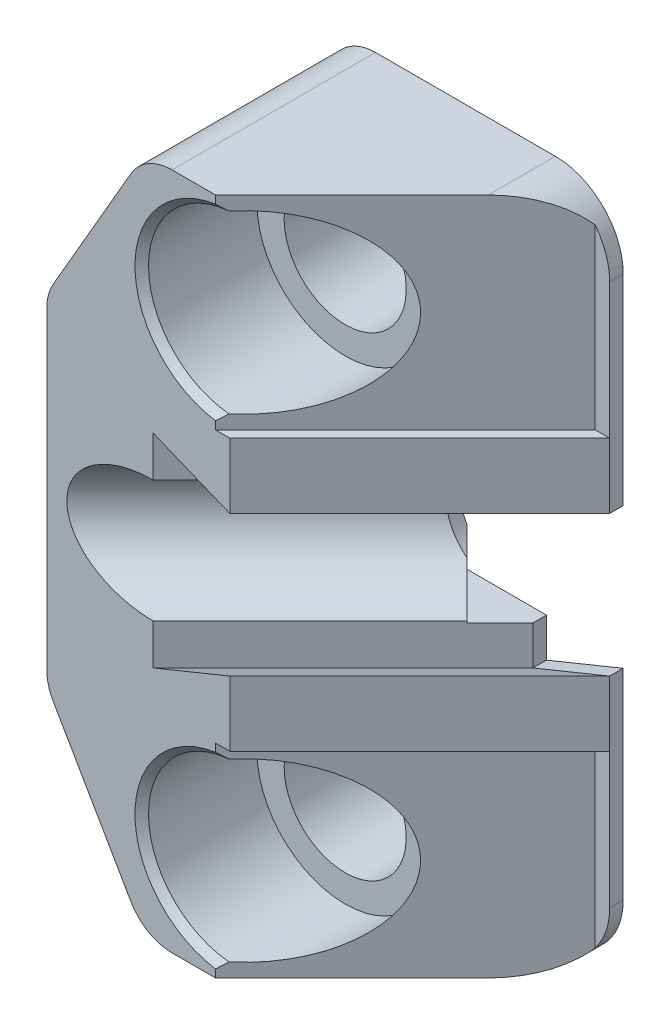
ISO-10303-21;
HEADER;
FILE_DESCRIPTION(('STEP AP214'),'2;1');
FILE_NAME('part.step','',(''),(''),'','','');
FILE_SCHEMA(('AUTOMOTIVE_DESIGN { 1 0 10303 214 1 1 1 1 }'));
ENDSEC;
DATA;
#1=APPLICATION_CONTEXT('core data for automotive mechanical design processes');
#2=APPLICATION_PROTOCOL_DEFINITION('international standard','automotive_design',2000,#1);
#3=PRODUCT_CONTEXT('',#1,'mechanical');
#4=PRODUCT('Part','Part','',(#3));
#5=PRODUCT_RELATED_PRODUCT_CATEGORY('part','',(#4));
#6=PRODUCT_DEFINITION_FORMATION('','',#4);
#7=PRODUCT_DEFINITION_CONTEXT('part definition',#1,'design');
#8=PRODUCT_DEFINITION('design','',#6,#7);
#9=PRODUCT_DEFINITION_SHAPE('','',#8);
#10=(LENGTH_UNIT() NAMED_UNIT(*) SI_UNIT(.MILLI.,.METRE.));
#11=(NAMED_UNIT(*) PLANE_ANGLE_UNIT() SI_UNIT($,.RADIAN.));
#12=(NAMED_UNIT(*) SI_UNIT($,.STERADIAN.) SOLID_ANGLE_UNIT());
#13=UNCERTAINTY_MEASURE_WITH_UNIT(LENGTH_MEASURE(1.E-05),#10,'distance_accuracy_value','');
#14=(GEOMETRIC_REPRESENTATION_CONTEXT(3) GLOBAL_UNCERTAINTY_ASSIGNED_CONTEXT((#13)) GLOBAL_UNIT_ASSIGNED_CONTEXT((#10,
#11,#12)) REPRESENTATION_CONTEXT('',''));
#15=CARTESIAN_POINT('',(0.,0.,0.));
#16=DIRECTION('',(0.,0.,1.));
#17=DIRECTION('',(1.,0.,0.));
#18=AXIS2_PLACEMENT_3D('',#15,#16,#17);
#19=CARTESIAN_POINT('',(28.,-15.,30.));
#20=DIRECTION('',(0.,1.,0.));
#21=DIRECTION('',(0.,0.,-1.));
#22=AXIS2_PLACEMENT_3D('',#19,#20,#21);
#23=PLANE('',#22);
#24=DIRECTION('',(-1.,0.,0.));
#25=VECTOR('',#24,1.);
#26=CARTESIAN_POINT('',(28.,-15.,0.));
#27=LINE('',#26,#25);
#28=CARTESIAN_POINT('',(18.,-15.,0.));
#29=VERTEX_POINT('',#28);
#30=CARTESIAN_POINT('',(-8.5247913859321,-15.,0.));
#31=VERTEX_POINT('',#30);
#32=EDGE_CURVE('E747',#29,#31,#27,.T.);
#33=ORIENTED_EDGE('',*,*,#32,.F.);
#34=DIRECTION('',(0.,0.,1.));
#35=VECTOR('',#34,1.);
#36=CARTESIAN_POINT('',(18.,-15.,30.));
#37=LINE('',#36,#35);
#38=CARTESIAN_POINT('',(18.,-15.,9.87867965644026));
#39=VERTEX_POINT('',#38);
#40=EDGE_CURVE('E422',#29,#39,#37,.T.);
#41=ORIENTED_EDGE('',*,*,#40,.T.);
#42=DIRECTION('',(-0.707106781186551,0.,0.707106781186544));
#43=VECTOR('',#42,1.);
#44=CARTESIAN_POINT('',(25.8786796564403,-15.,2.));
#45=LINE('',#44,#43);
#46=CARTESIAN_POINT('',(-2.12132034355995,-15.,30.));
#47=VERTEX_POINT('',#46);
#48=EDGE_CURVE('E286',#39,#47,#45,.T.);
#49=ORIENTED_EDGE('',*,*,#48,.T.);
#50=DIRECTION('',(1.,0.,0.));
#51=VECTOR('',#50,1.);
#52=CARTESIAN_POINT('',(28.,-15.,30.));
#53=LINE('',#52,#51);
#54=CARTESIAN_POINT('',(-8.5247913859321,-15.,30.));
#55=VERTEX_POINT('',#54);
#56=EDGE_CURVE('E648',#55,#47,#53,.T.);
#57=ORIENTED_EDGE('',*,*,#56,.F.);
#58=DIRECTION('',(0.,0.,1.));
#59=VECTOR('',#58,1.);
#60=CARTESIAN_POINT('',(-8.5247913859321,-15.,30.));
#61=LINE('',#60,#59);
#62=EDGE_CURVE('E677',#55,#31,#61,.F.);
#63=ORIENTED_EDGE('',*,*,#62,.T.);
#64=EDGE_LOOP('',(#33,#41,#49,#57,#63));
#65=FACE_BOUND('',#64,.T.);
#66=ADVANCED_FACE('F14',(#65),#23,.F.);
#67=CARTESIAN_POINT('',(28.,85.,30.));
#68=DIRECTION('',(0.,0.,1.));
#69=DIRECTION('',(-1.,0.,0.));
#70=AXIS2_PLACEMENT_3D('',#67,#68,#69);
#71=PLANE('',#70);
#72=ORIENTED_EDGE('',*,*,#56,.T.);
#73=DIRECTION('',(0.,-1.,0.));
#74=VECTOR('',#73,1.);
#75=CARTESIAN_POINT('',(-2.12132034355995,15.,30.));
#76=LINE('',#75,#74);
#77=CARTESIAN_POINT('',(-2.12132034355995,-13.838352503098,30.));
#78=VERTEX_POINT('',#77);
#79=EDGE_CURVE('E299',#78,#47,#76,.T.);
#80=ORIENTED_EDGE('',*,*,#79,.F.);
#81=CARTESIAN_POINT('',(0.,0.,30.));
#82=DIRECTION('',(0.,0.,1.));
#83=DIRECTION('',(-1.,0.,0.));
#84=AXIS2_PLACEMENT_3D('',#81,#82,#83);
#85=CIRCLE('',#84,14.);
#86=CARTESIAN_POINT('',(-2.12132034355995,13.838352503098,30.));
#87=VERTEX_POINT('',#86);
#88=EDGE_CURVE('E660',#78,#87,#85,.F.);
#89=ORIENTED_EDGE('',*,*,#88,.T.);
#90=CARTESIAN_POINT('',(-2.12132034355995,15.,30.));
#91=VERTEX_POINT('',#90);
#92=EDGE_CURVE('E304',#91,#87,#76,.T.);
#93=ORIENTED_EDGE('',*,*,#92,.F.);
#94=DIRECTION('',(1.,0.,0.));
#95=VECTOR('',#94,1.);
#96=CARTESIAN_POINT('',(-2.12132034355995,15.,30.));
#97=LINE('',#96,#95);
#98=CARTESIAN_POINT('',(-2.88831458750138E-13,15.,30.));
#99=VERTEX_POINT('',#98);
#100=EDGE_CURVE('E294',#91,#99,#97,.T.);
#101=ORIENTED_EDGE('',*,*,#100,.T.);
#102=DIRECTION('',(0.,1.,0.));
#103=VECTOR('',#102,1.);
#104=CARTESIAN_POINT('',(-2.88831458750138E-13,-15.,30.));
#105=LINE('',#104,#103);
#106=CARTESIAN_POINT('',(-2.9316826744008E-13,24.618802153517,30.));
#107=VERTEX_POINT('',#106);
#108=EDGE_CURVE('E640',#99,#107,#105,.T.);
#109=ORIENTED_EDGE('',*,*,#108,.T.);
#110=DIRECTION('',(0.925820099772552,0.377964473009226,0.));
#111=VECTOR('',#110,1.);
#112=CARTESIAN_POINT('',(45.1290178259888,43.0426465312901,30.));
#113=LINE('',#112,#111);
#114=CARTESIAN_POINT('',(-11.313708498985,20.,30.));
#115=VERTEX_POINT('',#114);
#116=EDGE_CURVE('E578',#115,#107,#113,.T.);
#117=ORIENTED_EDGE('',*,*,#116,.F.);
#118=DIRECTION('',(0.,-1.,0.));
#119=VECTOR('',#118,1.);
#120=CARTESIAN_POINT('',(-11.3137084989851,85.,30.));
#121=LINE('',#120,#119);
#122=CARTESIAN_POINT('',(-11.313708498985,26.,30.));
#123=VERTEX_POINT('',#122);
#124=EDGE_CURVE('E625',#123,#115,#121,.T.);
#125=ORIENTED_EDGE('',*,*,#124,.F.);
#126=CARTESIAN_POINT('',(-11.313708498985,35.,30.));
#127=DIRECTION('',(0.,0.,1.));
#128=DIRECTION('',(-1.,0.,0.));
#129=AXIS2_PLACEMENT_3D('',#126,#127,#128);
#130=ELLIPSE('',#129,12.7279220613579,9.);
#131=CARTESIAN_POINT('',(-11.313708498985,44.,30.));
#132=VERTEX_POINT('',#131);
#133=EDGE_CURVE('E622',#132,#123,#130,.T.);
#134=ORIENTED_EDGE('',*,*,#133,.F.);
#135=DIRECTION('',(0.,-1.,0.));
#136=VECTOR('',#135,1.);
#137=CARTESIAN_POINT('',(-11.3137084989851,85.,30.));
#138=LINE('',#137,#136);
#139=CARTESIAN_POINT('',(-11.313708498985,50.,30.));
#140=VERTEX_POINT('',#139);
#141=EDGE_CURVE('E619',#140,#132,#138,.T.);
#142=ORIENTED_EDGE('',*,*,#141,.F.);
#143=DIRECTION('',(-0.925820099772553,0.377964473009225,0.));
#144=VECTOR('',#143,1.);
#145=CARTESIAN_POINT('',(10.1363072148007,41.243067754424,30.));
#146=LINE('',#145,#144);
#147=CARTESIAN_POINT('',(-2.83627288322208E-13,45.381197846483,30.));
#148=VERTEX_POINT('',#147);
#149=EDGE_CURVE('E577',#148,#140,#146,.T.);
#150=ORIENTED_EDGE('',*,*,#149,.F.);
#151=CARTESIAN_POINT('',(-2.9316826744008E-13,55.,30.));
#152=VERTEX_POINT('',#151);
#153=EDGE_CURVE('E639',#148,#152,#105,.T.);
#154=ORIENTED_EDGE('',*,*,#153,.T.);
#155=DIRECTION('',(1.,0.,0.));
#156=VECTOR('',#155,1.);
#157=CARTESIAN_POINT('',(-2.12132034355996,55.,30.));
#158=LINE('',#157,#156);
#159=CARTESIAN_POINT('',(-2.12132034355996,55.,30.));
#160=VERTEX_POINT('',#159);
#161=EDGE_CURVE('E315',#160,#152,#158,.T.);
#162=ORIENTED_EDGE('',*,*,#161,.F.);
#163=DIRECTION('',(0.,1.,0.));
#164=VECTOR('',#163,1.);
#165=CARTESIAN_POINT('',(-2.12132034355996,55.,30.));
#166=LINE('',#165,#164);
#167=CARTESIAN_POINT('',(-2.12132034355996,56.161647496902,30.));
#168=VERTEX_POINT('',#167);
#169=EDGE_CURVE('E325',#160,#168,#166,.T.);
#170=ORIENTED_EDGE('',*,*,#169,.T.);
#171=CARTESIAN_POINT('',(0.,70.,30.));
#172=DIRECTION('',(0.,0.,1.));
#173=DIRECTION('',(-1.,0.,0.));
#174=AXIS2_PLACEMENT_3D('',#171,#172,#173);
#175=CIRCLE('',#174,14.);
#176=CARTESIAN_POINT('',(-2.12132034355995,83.838352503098,30.));
#177=VERTEX_POINT('',#176);
#178=EDGE_CURVE('E663',#168,#177,#175,.F.);
#179=ORIENTED_EDGE('',*,*,#178,.T.);
#180=CARTESIAN_POINT('',(-2.12132034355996,85.,30.));
#181=VERTEX_POINT('',#180);
#182=EDGE_CURVE('E328',#177,#181,#166,.T.);
#183=ORIENTED_EDGE('',*,*,#182,.T.);
#184=DIRECTION('',(-1.,0.,0.));
#185=VECTOR('',#184,1.);
#186=CARTESIAN_POINT('',(28.,85.,30.));
#187=LINE('',#186,#185);
#188=CARTESIAN_POINT('',(-8.52479138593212,85.,30.));
#189=VERTEX_POINT('',#188);
#190=EDGE_CURVE('E645',#181,#189,#187,.T.);
#191=ORIENTED_EDGE('',*,*,#190,.T.);
#192=CARTESIAN_POINT('',(-8.52479138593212,78.,30.));
#193=DIRECTION('',(0.,0.,1.));
#194=DIRECTION('',(-1.,0.,0.));
#195=AXIS2_PLACEMENT_3D('',#192,#193,#194);
#196=CIRCLE('',#195,7.);
#197=CARTESIAN_POINT('',(-14.5869692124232,81.5,30.));
#198=VERTEX_POINT('',#197);
#199=EDGE_CURVE('E672',#189,#198,#196,.T.);
#200=ORIENTED_EDGE('',*,*,#199,.T.);
#201=DIRECTION('',(0.5,0.866025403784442,0.));
#202=VECTOR('',#201,1.);
#203=CARTESIAN_POINT('',(-27.,60.,30.));
#204=LINE('',#203,#202);
#205=CARTESIAN_POINT('',(-26.0621778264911,61.6243556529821,30.));
#206=VERTEX_POINT('',#205);
#207=EDGE_CURVE('E584',#206,#198,#204,.T.);
#208=ORIENTED_EDGE('',*,*,#207,.F.);
#209=CARTESIAN_POINT('',(-20.,58.1243556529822,30.));
#210=DIRECTION('',(0.,0.,1.));
#211=DIRECTION('',(-1.,0.,0.));
#212=AXIS2_PLACEMENT_3D('',#209,#210,#211);
#213=CIRCLE('',#212,7.);
#214=CARTESIAN_POINT('',(-27.,58.1243556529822,30.));
#215=VERTEX_POINT('',#214);
#216=EDGE_CURVE('E695',#206,#215,#213,.T.);
#217=ORIENTED_EDGE('',*,*,#216,.T.);
#218=DIRECTION('',(0.,1.,0.));
#219=VECTOR('',#218,1.);
#220=CARTESIAN_POINT('',(-27.,-15.,30.));
#221=LINE('',#220,#219);
#222=CARTESIAN_POINT('',(-27.,11.8756443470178,30.));
#223=VERTEX_POINT('',#222);
#224=EDGE_CURVE('E595',#223,#215,#221,.T.);
#225=ORIENTED_EDGE('',*,*,#224,.F.);
#226=CARTESIAN_POINT('',(-20.,11.8756443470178,30.));
#227=DIRECTION('',(0.,0.,1.));
#228=DIRECTION('',(-1.,0.,0.));
#229=AXIS2_PLACEMENT_3D('',#226,#227,#228);
#230=CIRCLE('',#229,7.);
#231=CARTESIAN_POINT('',(-26.0621778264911,8.3756443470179,30.));
#232=VERTEX_POINT('',#231);
#233=EDGE_CURVE('E697',#223,#232,#230,.T.);
#234=ORIENTED_EDGE('',*,*,#233,.T.);
#235=DIRECTION('',(-0.5,0.866025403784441,0.));
#236=VECTOR('',#235,1.);
#237=CARTESIAN_POINT('',(-27.,10.,30.));
#238=LINE('',#237,#236);
#239=CARTESIAN_POINT('',(-14.5869692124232,-11.5,30.));
#240=VERTEX_POINT('',#239);
#241=EDGE_CURVE('E592',#240,#232,#238,.T.);
#242=ORIENTED_EDGE('',*,*,#241,.F.);
#243=CARTESIAN_POINT('',(-8.52479138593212,-8.,30.));
#244=DIRECTION('',(0.,0.,1.));
#245=DIRECTION('',(-1.,0.,0.));
#246=AXIS2_PLACEMENT_3D('',#243,#244,#245);
#247=CIRCLE('',#246,7.);
#248=EDGE_CURVE('E675',#240,#55,#247,.T.);
#249=ORIENTED_EDGE('',*,*,#248,.T.);
#250=EDGE_LOOP('',(#72,#80,#89,#93,#101,#109,#117,#125,#134,#142,#150,#154,#162,#170,#179,#183,
#191,#200,#208,#217,#225,#234,#242,#249));
#251=FACE_BOUND('',#250,.T.);
#252=ADVANCED_FACE('F487',(#251),#71,.T.);
#253=CARTESIAN_POINT('',(28.,-15.,2.));
#254=DIRECTION('',(-0.707106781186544,0.,-0.707106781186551));
#255=DIRECTION('',(0.707106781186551,0.,-0.707106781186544));
#256=AXIS2_PLACEMENT_3D('',#253,#254,#255);
#257=PLANE('',#256);
#258=DIRECTION('',(0.707106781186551,0.,-0.707106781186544));
#259=VECTOR('',#258,1.);
#260=CARTESIAN_POINT('',(28.,15.,2.));
#261=LINE('',#260,#259);
#262=CARTESIAN_POINT('',(28.,15.,2.));
#263=VERTEX_POINT('',#262);
#264=EDGE_CURVE('E291',#99,#263,#261,.T.);
#265=ORIENTED_EDGE('',*,*,#264,.T.);
#266=DIRECTION('',(0.,1.,0.));
#267=VECTOR('',#266,1.);
#268=CARTESIAN_POINT('',(28.,-15.,2.));
#269=LINE('',#268,#267);
#270=CARTESIAN_POINT('',(28.,24.618802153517,1.99999999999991));
#271=VERTEX_POINT('',#270);
#272=EDGE_CURVE('E646',#263,#271,#269,.T.);
#273=ORIENTED_EDGE('',*,*,#272,.T.);
#274=DIRECTION('',(-0.707106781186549,0.,0.707106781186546));
#275=VECTOR('',#274,1.);
#276=CARTESIAN_POINT('',(28.,24.618802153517,1.99999999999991));
#277=LINE('',#276,#275);
#278=EDGE_CURVE('E602',#271,#107,#277,.T.);
#279=ORIENTED_EDGE('',*,*,#278,.T.);
#280=ORIENTED_EDGE('',*,*,#108,.F.);
#281=EDGE_LOOP('',(#265,#273,#279,#280));
#282=FACE_BOUND('',#281,.T.);
#283=ADVANCED_FACE('F493',(#282),#257,.F.);
#284=CARTESIAN_POINT('',(0.,0.,30.));
#285=DIRECTION('',(0.,0.,1.));
#286=DIRECTION('',(-1.,0.,0.));
#287=AXIS2_PLACEMENT_3D('',#284,#285,#286);
#288=CYLINDRICAL_SURFACE('',#287,13.);
#289=CARTESIAN_POINT('',(0.,0.,13.));
#290=DIRECTION('',(0.,0.,1.));
#291=DIRECTION('',(-1.,0.,0.));
#292=AXIS2_PLACEMENT_3D('',#289,#290,#291);
#293=CIRCLE('',#292,13.);
#294=CARTESIAN_POINT('',(-13.,0.,13.));
#295=VERTEX_POINT('',#294);
#296=EDGE_CURVE('E630',#295,#295,#293,.T.);
#297=ORIENTED_EDGE('',*,*,#296,.F.);
#298=EDGE_LOOP('',(#297));
#299=FACE_BOUND('',#298,.T.);
#300=CARTESIAN_POINT('',(0.,0.,27.8786796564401));
#301=DIRECTION('',(0.707106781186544,0.,0.707106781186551));
#302=DIRECTION('',(-0.707106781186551,0.,0.707106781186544));
#303=AXIS2_PLACEMENT_3D('',#300,#301,#302);
#304=ELLIPSE('',#303,18.3847763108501,13.);
#305=CARTESIAN_POINT('',(-1.12132034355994,12.9515497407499,29.));
#306=VERTEX_POINT('',#305);
#307=CARTESIAN_POINT('',(-1.12132034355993,-12.9515497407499,29.));
#308=VERTEX_POINT('',#307);
#309=EDGE_CURVE('E303',#306,#308,#304,.F.);
#310=ORIENTED_EDGE('',*,*,#309,.F.);
#311=CARTESIAN_POINT('',(0.,0.,29.));
#312=DIRECTION('',(0.,0.,1.));
#313=DIRECTION('',(-1.,0.,0.));
#314=AXIS2_PLACEMENT_3D('',#311,#312,#313);
#315=CIRCLE('',#314,13.);
#316=EDGE_CURVE('E666',#306,#308,#315,.T.);
#317=ORIENTED_EDGE('',*,*,#316,.T.);
#318=EDGE_LOOP('',(#310,#317));
#319=FACE_BOUND('',#318,.T.);
#320=ADVANCED_FACE('F430',(#299,#319),#288,.F.);
#321=CARTESIAN_POINT('',(0.,0.,29.));
#322=DIRECTION('',(0.,0.,1.));
#323=DIRECTION('',(-1.,0.,0.));
#324=AXIS2_PLACEMENT_3D('',#321,#322,#323);
#325=CONICAL_SURFACE('',#324,13.,0.78539816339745);
#326=ORIENTED_EDGE('',*,*,#316,.F.);
#327=CARTESIAN_POINT('',(-1.12112034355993,12.9513663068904,28.9998));
#328=CARTESIAN_POINT('',(-1.20368506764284,13.0270922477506,29.0823647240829));
#329=CARTESIAN_POINT('',(-1.28646372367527,13.1023511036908,29.1651433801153));
#330=CARTESIAN_POINT('',(-1.45242484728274,13.2519586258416,29.3311045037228));
#331=CARTESIAN_POINT('',(-1.53560729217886,13.3263073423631,29.4142869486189));
#332=CARTESIAN_POINT('',(-1.70236068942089,13.4741265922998,29.581040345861));
#333=CARTESIAN_POINT('',(-1.78593163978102,13.5475971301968,29.6646112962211));
#334=CARTESIAN_POINT('',(-1.95344952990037,13.6936907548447,29.8321291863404));
#335=CARTESIAN_POINT('',(-2.03739649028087,13.7663137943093,29.9160761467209));
#336=CARTESIAN_POINT('',(-2.12152034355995,13.8385241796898,30.0002));
#337=B_SPLINE_CURVE_WITH_KNOTS('',3,(#327,#328,#329,#330,#331,#332,#333,#334,#335,#336),
.UNSPECIFIED.,.F.,.F.,(4,2,2,2,4),(0.,0.417508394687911,0.834993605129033,1.2524766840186,
1.66998294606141),.UNSPECIFIED.);
#338=EDGE_CURVE('E415',#306,#87,#337,.T.);
#339=ORIENTED_EDGE('',*,*,#338,.T.);
#340=ORIENTED_EDGE('',*,*,#88,.F.);
#341=CARTESIAN_POINT('',(-2.12152034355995,-13.8385241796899,30.0002));
#342=CARTESIAN_POINT('',(-2.03739649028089,-13.7663137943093,29.9160761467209));
#343=CARTESIAN_POINT('',(-1.9534495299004,-13.6936907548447,29.8321291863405));
#344=CARTESIAN_POINT('',(-1.78593163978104,-13.5475971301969,29.6646112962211));
#345=CARTESIAN_POINT('',(-1.70236068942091,-13.4741265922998,29.581040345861));
#346=CARTESIAN_POINT('',(-1.53560729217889,-13.3263073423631,29.414286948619));
#347=CARTESIAN_POINT('',(-1.45242484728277,-13.2519586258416,29.3311045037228));
#348=CARTESIAN_POINT('',(-1.28646372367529,-13.1023511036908,29.1651433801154));
#349=CARTESIAN_POINT('',(-1.20368506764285,-13.0270922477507,29.0823647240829));
#350=CARTESIAN_POINT('',(-1.1211203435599,-12.9513663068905,28.9998));
#351=B_SPLINE_CURVE_WITH_KNOTS('',3,(#341,#342,#343,#344,#345,#346,#347,#348,#349,#350),
.UNSPECIFIED.,.F.,.F.,(4,2,2,2,4),(0.,0.417506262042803,0.834989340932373,1.2524745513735,
1.6699829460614),.UNSPECIFIED.);
#352=EDGE_CURVE('E407',#78,#308,#351,.T.);
#353=ORIENTED_EDGE('',*,*,#352,.T.);
#354=EDGE_LOOP('',(#326,#339,#340,#353));
#355=FACE_BOUND('',#354,.T.);
#356=ADVANCED_FACE('F424',(#355),#325,.F.);
#357=DIRECTION('',(0.707106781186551,0.,-0.707106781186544));
#358=VECTOR('',#357,1.);
#359=CARTESIAN_POINT('',(28.,55.,2.));
#360=LINE('',#359,#358);
#361=CARTESIAN_POINT('',(28.,55.,2.));
#362=VERTEX_POINT('',#361);
#363=EDGE_CURVE('E317',#152,#362,#360,.T.);
#364=ORIENTED_EDGE('',*,*,#363,.F.);
#365=ORIENTED_EDGE('',*,*,#153,.F.);
#366=DIRECTION('',(-0.707106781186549,0.,0.707106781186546));
#367=VECTOR('',#366,1.);
#368=CARTESIAN_POINT('',(28.,45.381197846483,1.99999999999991));
#369=LINE('',#368,#367);
#370=CARTESIAN_POINT('',(28.,45.381197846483,1.99999999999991));
#371=VERTEX_POINT('',#370);
#372=EDGE_CURVE('E599',#371,#148,#369,.T.);
#373=ORIENTED_EDGE('',*,*,#372,.F.);
#374=EDGE_CURVE('E642',#371,#362,#269,.T.);
#375=ORIENTED_EDGE('',*,*,#374,.T.);
#376=EDGE_LOOP('',(#364,#365,#373,#375));
#377=FACE_BOUND('',#376,.T.);
#378=ADVANCED_FACE('F429',(#377),#257,.F.);
#379=CARTESIAN_POINT('',(28.,85.,30.));
#380=DIRECTION('',(0.,-1.,0.));
#381=DIRECTION('',(0.,0.,1.));
#382=AXIS2_PLACEMENT_3D('',#379,#380,#381);
#383=PLANE('',#382);
#384=DIRECTION('',(-0.707106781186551,0.,0.707106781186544));
#385=VECTOR('',#384,1.);
#386=CARTESIAN_POINT('',(25.8786796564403,85.,2.));
#387=LINE('',#386,#385);
#388=CARTESIAN_POINT('',(18.,85.,9.87867965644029));
#389=VERTEX_POINT('',#388);
#390=EDGE_CURVE('E307',#389,#181,#387,.T.);
#391=ORIENTED_EDGE('',*,*,#390,.F.);
#392=DIRECTION('',(0.,0.,1.));
#393=VECTOR('',#392,1.);
#394=CARTESIAN_POINT('',(18.,85.,30.));
#395=LINE('',#394,#393);
#396=CARTESIAN_POINT('',(18.,85.,0.));
#397=VERTEX_POINT('',#396);
#398=EDGE_CURVE('E721',#389,#397,#395,.F.);
#399=ORIENTED_EDGE('',*,*,#398,.T.);
#400=DIRECTION('',(1.,0.,0.));
#401=VECTOR('',#400,1.);
#402=CARTESIAN_POINT('',(-12.5662432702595,85.,0.));
#403=LINE('',#402,#401);
#404=CARTESIAN_POINT('',(-8.52479138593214,85.,0.));
#405=VERTEX_POINT('',#404);
#406=EDGE_CURVE('E341',#405,#397,#403,.T.);
#407=ORIENTED_EDGE('',*,*,#406,.F.);
#408=DIRECTION('',(0.,0.,1.));
#409=VECTOR('',#408,1.);
#410=CARTESIAN_POINT('',(-8.52479138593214,85.,30.));
#411=LINE('',#410,#409);
#412=EDGE_CURVE('E684',#405,#189,#411,.T.);
#413=ORIENTED_EDGE('',*,*,#412,.T.);
#414=ORIENTED_EDGE('',*,*,#190,.F.);
#415=EDGE_LOOP('',(#391,#399,#407,#413,#414));
#416=FACE_BOUND('',#415,.T.);
#417=ADVANCED_FACE('F16',(#416),#383,.F.);
#418=CARTESIAN_POINT('',(0.,70.,30.));
#419=DIRECTION('',(0.,0.,1.));
#420=DIRECTION('',(-1.,0.,0.));
#421=AXIS2_PLACEMENT_3D('',#418,#419,#420);
#422=CYLINDRICAL_SURFACE('',#421,13.);
#423=CARTESIAN_POINT('',(0.,70.,13.));
#424=DIRECTION('',(0.,0.,1.));
#425=DIRECTION('',(-1.,0.,0.));
#426=AXIS2_PLACEMENT_3D('',#423,#424,#425);
#427=CIRCLE('',#426,13.);
#428=CARTESIAN_POINT('',(-13.,70.,13.));
#429=VERTEX_POINT('',#428);
#430=EDGE_CURVE('E636',#429,#429,#427,.T.);
#431=ORIENTED_EDGE('',*,*,#430,.F.);
#432=EDGE_LOOP('',(#431));
#433=FACE_BOUND('',#432,.T.);
#434=CARTESIAN_POINT('',(0.,70.,29.));
#435=DIRECTION('',(0.,0.,1.));
#436=DIRECTION('',(-1.,0.,0.));
#437=AXIS2_PLACEMENT_3D('',#434,#435,#436);
#438=CIRCLE('',#437,13.);
#439=CARTESIAN_POINT('',(-1.12132034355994,82.9515497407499,29.));
#440=VERTEX_POINT('',#439);
#441=CARTESIAN_POINT('',(-1.12132034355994,57.0484502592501,29.));
#442=VERTEX_POINT('',#441);
#443=EDGE_CURVE('E657',#440,#442,#438,.T.);
#444=ORIENTED_EDGE('',*,*,#443,.T.);
#445=CARTESIAN_POINT('',(0.,70.,27.8786796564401));
#446=DIRECTION('',(-0.707106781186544,0.,-0.707106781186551));
#447=DIRECTION('',(-0.707106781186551,0.,0.707106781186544));
#448=AXIS2_PLACEMENT_3D('',#445,#446,#447);
#449=ELLIPSE('',#448,18.3847763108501,13.);
#450=EDGE_CURVE('E324',#442,#440,#449,.F.);
#451=ORIENTED_EDGE('',*,*,#450,.T.);
#452=EDGE_LOOP('',(#444,#451));
#453=FACE_BOUND('',#452,.T.);
#454=ADVANCED_FACE('F501',(#433,#453),#422,.F.);
#455=CARTESIAN_POINT('',(-9.,70.,13.));
#456=DIRECTION('',(0.,0.,-1.));
#457=DIRECTION('',(1.,0.,0.));
#458=AXIS2_PLACEMENT_3D('',#455,#456,#457);
#459=PLANE('',#458);
#460=CARTESIAN_POINT('',(0.,70.,13.));
#461=DIRECTION('',(0.,0.,1.));
#462=DIRECTION('',(-1.,0.,0.));
#463=AXIS2_PLACEMENT_3D('',#460,#461,#462);
#464=CIRCLE('',#463,9.);
#465=CARTESIAN_POINT('',(-9.,70.,13.));
#466=VERTEX_POINT('',#465);
#467=EDGE_CURVE('E633',#466,#466,#464,.T.);
#468=ORIENTED_EDGE('',*,*,#467,.F.);
#469=EDGE_LOOP('',(#468));
#470=FACE_BOUND('',#469,.T.);
#471=ORIENTED_EDGE('',*,*,#430,.T.);
#472=EDGE_LOOP('',(#471));
#473=FACE_BOUND('',#472,.T.);
#474=ADVANCED_FACE('F504',(#470,#473),#459,.F.);
#475=CARTESIAN_POINT('',(0.,70.,30.));
#476=DIRECTION('',(0.,0.,1.));
#477=DIRECTION('',(-1.,0.,0.));
#478=AXIS2_PLACEMENT_3D('',#475,#476,#477);
#479=CYLINDRICAL_SURFACE('',#478,9.);
#480=ORIENTED_EDGE('',*,*,#467,.T.);
#481=EDGE_LOOP('',(#480));
#482=FACE_BOUND('',#481,.T.);
#483=CARTESIAN_POINT('',(0.,70.,0.));
#484=DIRECTION('',(0.,0.,1.));
#485=DIRECTION('',(-1.,0.,0.));
#486=AXIS2_PLACEMENT_3D('',#483,#484,#485);
#487=CIRCLE('',#486,9.);
#488=CARTESIAN_POINT('',(-9.,70.,0.));
#489=VERTEX_POINT('',#488);
#490=EDGE_CURVE('E257',#489,#489,#487,.T.);
#491=ORIENTED_EDGE('',*,*,#490,.F.);
#492=EDGE_LOOP('',(#491));
#493=FACE_BOUND('',#492,.T.);
#494=ADVANCED_FACE('F508',(#482,#493),#479,.F.);
#495=CARTESIAN_POINT('',(-9.,0.,13.));
#496=DIRECTION('',(0.,0.,-1.));
#497=DIRECTION('',(1.,0.,0.));
#498=AXIS2_PLACEMENT_3D('',#495,#496,#497);
#499=PLANE('',#498);
#500=CARTESIAN_POINT('',(0.,0.,13.));
#501=DIRECTION('',(0.,0.,1.));
#502=DIRECTION('',(-1.,0.,0.));
#503=AXIS2_PLACEMENT_3D('',#500,#501,#502);
#504=CIRCLE('',#503,9.);
#505=CARTESIAN_POINT('',(-9.,0.,13.));
#506=VERTEX_POINT('',#505);
#507=EDGE_CURVE('E627',#506,#506,#504,.T.);
#508=ORIENTED_EDGE('',*,*,#507,.F.);
#509=EDGE_LOOP('',(#508));
#510=FACE_BOUND('',#509,.T.);
#511=ORIENTED_EDGE('',*,*,#296,.T.);
#512=EDGE_LOOP('',(#511));
#513=FACE_BOUND('',#512,.T.);
#514=ADVANCED_FACE('F512',(#510,#513),#499,.F.);
#515=CARTESIAN_POINT('',(0.,0.,30.));
#516=DIRECTION('',(0.,0.,1.));
#517=DIRECTION('',(-1.,0.,0.));
#518=AXIS2_PLACEMENT_3D('',#515,#516,#517);
#519=CYLINDRICAL_SURFACE('',#518,9.);
#520=ORIENTED_EDGE('',*,*,#507,.T.);
#521=EDGE_LOOP('',(#520));
#522=FACE_BOUND('',#521,.T.);
#523=CARTESIAN_POINT('',(0.,0.,0.));
#524=DIRECTION('',(0.,0.,1.));
#525=DIRECTION('',(-1.,0.,0.));
#526=AXIS2_PLACEMENT_3D('',#523,#524,#525);
#527=CIRCLE('',#526,9.);
#528=CARTESIAN_POINT('',(-9.,0.,0.));
#529=VERTEX_POINT('',#528);
#530=EDGE_CURVE('E809',#529,#529,#527,.T.);
#531=ORIENTED_EDGE('',*,*,#530,.F.);
#532=EDGE_LOOP('',(#531));
#533=FACE_BOUND('',#532,.T.);
#534=ADVANCED_FACE('F519',(#522,#533),#519,.F.);
#535=CARTESIAN_POINT('',(22.3431457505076,20.,-3.65685424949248));
#536=DIRECTION('',(-0.707106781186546,0.,-0.707106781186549));
#537=DIRECTION('',(0.707106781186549,0.,-0.707106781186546));
#538=AXIS2_PLACEMENT_3D('',#535,#536,#537);
#539=PLANE('',#538);
#540=DIRECTION('',(-0.707106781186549,0.,0.707106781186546));
#541=VECTOR('',#540,1.);
#542=CARTESIAN_POINT('',(22.3431457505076,25.75,-3.65685424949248));
#543=LINE('',#542,#541);
#544=CARTESIAN_POINT('',(16.6862915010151,25.75,2.));
#545=VERTEX_POINT('',#544);
#546=CARTESIAN_POINT('',(11.8431457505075,25.75,6.84314575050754));
#547=VERTEX_POINT('',#546);
#548=EDGE_CURVE('E283',#545,#547,#543,.T.);
#549=ORIENTED_EDGE('',*,*,#548,.T.);
#550=DIRECTION('',(0.,1.,0.));
#551=VECTOR('',#550,1.);
#552=CARTESIAN_POINT('',(11.8431457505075,20.,6.84314575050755));
#553=LINE('',#552,#551);
#554=CARTESIAN_POINT('',(11.8431457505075,26.,6.84314575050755));
#555=VERTEX_POINT('',#554);
#556=EDGE_CURVE('E275',#547,#555,#553,.T.);
#557=ORIENTED_EDGE('',*,*,#556,.T.);
#558=DIRECTION('',(-0.707106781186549,0.,0.707106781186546));
#559=VECTOR('',#558,1.);
#560=CARTESIAN_POINT('',(22.3431457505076,26.,-3.65685424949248));
#561=LINE('',#560,#559);
#562=EDGE_CURVE('E608',#555,#123,#561,.T.);
#563=ORIENTED_EDGE('',*,*,#562,.T.);
#564=ORIENTED_EDGE('',*,*,#124,.T.);
#565=DIRECTION('',(-0.707106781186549,0.,0.707106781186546));
#566=VECTOR('',#565,1.);
#567=CARTESIAN_POINT('',(22.3431457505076,20.,-3.65685424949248));
#568=LINE('',#567,#566);
#569=CARTESIAN_POINT('',(16.6862915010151,20.,2.));
#570=VERTEX_POINT('',#569);
#571=EDGE_CURVE('E605',#570,#115,#568,.T.);
#572=ORIENTED_EDGE('',*,*,#571,.F.);
#573=DIRECTION('',(0.,-1.,0.));
#574=VECTOR('',#573,1.);
#575=CARTESIAN_POINT('',(16.686291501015,85.,2.));
#576=LINE('',#575,#574);
#577=EDGE_CURVE('E655',#545,#570,#576,.T.);
#578=ORIENTED_EDGE('',*,*,#577,.F.);
#579=EDGE_LOOP('',(#549,#557,#563,#564,#572,#578));
#580=FACE_BOUND('',#579,.T.);
#581=ADVANCED_FACE('F523',(#580),#539,.F.);
#582=CARTESIAN_POINT('',(22.3431457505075,35.,-3.65685424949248));
#583=DIRECTION('',(-0.707106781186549,0.,0.707106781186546));
#584=DIRECTION('',(-0.707106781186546,0.,-0.707106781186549));
#585=AXIS2_PLACEMENT_3D('',#582,#583,#584);
#586=CYLINDRICAL_SURFACE('',#585,9.);
#587=CARTESIAN_POINT('',(16.686291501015,35.,2.));
#588=DIRECTION('',(0.,0.,1.));
#589=DIRECTION('',(-1.,0.,0.));
#590=AXIS2_PLACEMENT_3D('',#587,#588,#589);
#591=ELLIPSE('',#590,12.7279220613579,9.);
#592=CARTESIAN_POINT('',(7.,40.8384825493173,2.));
#593=VERTEX_POINT('',#592);
#594=CARTESIAN_POINT('',(7.,29.1615174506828,2.));
#595=VERTEX_POINT('',#594);
#596=EDGE_CURVE('E652',#593,#595,#591,.T.);
#597=ORIENTED_EDGE('',*,*,#596,.F.);
#598=CARTESIAN_POINT('',(11.8431457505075,35.,6.84314575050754));
#599=DIRECTION('',(-0.707106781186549,0.,0.707106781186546));
#600=DIRECTION('',(-0.707106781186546,0.,-0.707106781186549));
#601=AXIS2_PLACEMENT_3D('',#598,#599,#600);
#602=CIRCLE('',#601,9.);
#603=CARTESIAN_POINT('',(11.8431457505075,44.,6.84314575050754));
#604=VERTEX_POINT('',#603);
#605=EDGE_CURVE('E276',#593,#604,#602,.F.);
#606=ORIENTED_EDGE('',*,*,#605,.T.);
#607=DIRECTION('',(-0.707106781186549,0.,0.707106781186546));
#608=VECTOR('',#607,1.);
#609=CARTESIAN_POINT('',(22.3431457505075,44.,-3.65685424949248));
#610=LINE('',#609,#608);
#611=EDGE_CURVE('E610',#604,#132,#610,.T.);
#612=ORIENTED_EDGE('',*,*,#611,.T.);
#613=ORIENTED_EDGE('',*,*,#133,.T.);
#614=ORIENTED_EDGE('',*,*,#562,.F.);
#615=EDGE_CURVE('E269',#555,#595,#602,.F.);
#616=ORIENTED_EDGE('',*,*,#615,.T.);
#617=EDGE_LOOP('',(#597,#606,#612,#613,#614,#616));
#618=FACE_BOUND('',#617,.T.);
#619=ADVANCED_FACE('F533',(#618),#586,.F.);
#620=CARTESIAN_POINT('',(22.3431457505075,44.,-3.65685424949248));
#621=DIRECTION('',(-0.707106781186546,0.,-0.707106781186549));
#622=DIRECTION('',(0.707106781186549,0.,-0.707106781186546));
#623=AXIS2_PLACEMENT_3D('',#620,#621,#622);
#624=PLANE('',#623);
#625=ORIENTED_EDGE('',*,*,#611,.F.);
#626=DIRECTION('',(0.,1.,0.));
#627=VECTOR('',#626,1.);
#628=CARTESIAN_POINT('',(11.8431457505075,44.,6.84314575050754));
#629=LINE('',#628,#627);
#630=CARTESIAN_POINT('',(11.8431457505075,44.25,6.84314575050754));
#631=VERTEX_POINT('',#630);
#632=EDGE_CURVE('E279',#604,#631,#629,.T.);
#633=ORIENTED_EDGE('',*,*,#632,.T.);
#634=DIRECTION('',(0.707106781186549,0.,-0.707106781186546));
#635=VECTOR('',#634,1.);
#636=CARTESIAN_POINT('',(22.3431457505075,44.25,-3.65685424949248));
#637=LINE('',#636,#635);
#638=CARTESIAN_POINT('',(16.686291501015,44.25,2.));
#639=VERTEX_POINT('',#638);
#640=EDGE_CURVE('E261',#631,#639,#637,.T.);
#641=ORIENTED_EDGE('',*,*,#640,.T.);
#642=DIRECTION('',(0.,-1.,0.));
#643=VECTOR('',#642,1.);
#644=CARTESIAN_POINT('',(16.686291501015,85.,2.));
#645=LINE('',#644,#643);
#646=CARTESIAN_POINT('',(16.686291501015,50.,2.));
#647=VERTEX_POINT('',#646);
#648=EDGE_CURVE('E581',#647,#639,#645,.T.);
#649=ORIENTED_EDGE('',*,*,#648,.F.);
#650=DIRECTION('',(-0.707106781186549,0.,0.707106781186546));
#651=VECTOR('',#650,1.);
#652=CARTESIAN_POINT('',(22.3431457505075,50.,-3.65685424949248));
#653=LINE('',#652,#651);
#654=EDGE_CURVE('E598',#647,#140,#653,.T.);
#655=ORIENTED_EDGE('',*,*,#654,.T.);
#656=ORIENTED_EDGE('',*,*,#141,.T.);
#657=EDGE_LOOP('',(#625,#633,#641,#649,#655,#656));
#658=FACE_BOUND('',#657,.T.);
#659=ADVANCED_FACE('F529',(#658),#624,.F.);
#660=CARTESIAN_POINT('',(22.3431457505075,50.,-3.65685424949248));
#661=DIRECTION('',(0.353553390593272,0.86602540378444,0.353553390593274));
#662=DIRECTION('',(0.,0.377964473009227,-0.925820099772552));
#663=AXIS2_PLACEMENT_3D('',#660,#661,#662);
#664=PLANE('',#663);
#665=ORIENTED_EDGE('',*,*,#149,.T.);
#666=ORIENTED_EDGE('',*,*,#654,.F.);
#667=DIRECTION('',(-0.925820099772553,0.377964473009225,0.));
#668=VECTOR('',#667,1.);
#669=CARTESIAN_POINT('',(14.1363072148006,51.0410267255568,2.));
#670=LINE('',#669,#668);
#671=EDGE_CURVE('E569',#371,#647,#670,.T.);
#672=ORIENTED_EDGE('',*,*,#671,.F.);
#673=ORIENTED_EDGE('',*,*,#372,.T.);
#674=EDGE_LOOP('',(#665,#666,#672,#673));
#675=FACE_BOUND('',#674,.T.);
#676=ADVANCED_FACE('F525',(#675),#664,.F.);
#677=CARTESIAN_POINT('',(22.3431457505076,20.,-3.65685424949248));
#678=DIRECTION('',(0.353553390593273,-0.866025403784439,0.353553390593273));
#679=DIRECTION('',(0.,0.377964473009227,0.925820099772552));
#680=AXIS2_PLACEMENT_3D('',#677,#678,#679);
#681=PLANE('',#680);
#682=ORIENTED_EDGE('',*,*,#116,.T.);
#683=ORIENTED_EDGE('',*,*,#278,.F.);
#684=DIRECTION('',(0.925820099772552,0.377964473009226,0.));
#685=VECTOR('',#684,1.);
#686=CARTESIAN_POINT('',(49.1290178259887,33.2446875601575,2.));
#687=LINE('',#686,#685);
#688=EDGE_CURVE('E601',#570,#271,#687,.T.);
#689=ORIENTED_EDGE('',*,*,#688,.F.);
#690=ORIENTED_EDGE('',*,*,#571,.T.);
#691=EDGE_LOOP('',(#682,#683,#689,#690));
#692=FACE_BOUND('',#691,.T.);
#693=ADVANCED_FACE('F528',(#692),#681,.F.);
#694=CARTESIAN_POINT('',(-27.,-15.,1.9999999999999));
#695=DIRECTION('',(1.,0.,0.));
#696=DIRECTION('',(0.,1.,0.));
#697=AXIS2_PLACEMENT_3D('',#694,#695,#696);
#698=PLANE('',#697);
#699=DIRECTION('',(0.,1.,0.));
#700=VECTOR('',#699,1.);
#701=CARTESIAN_POINT('',(-27.,10.,0.));
#702=LINE('',#701,#700);
#703=CARTESIAN_POINT('',(-27.,11.8756443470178,0.));
#704=VERTEX_POINT('',#703);
#705=CARTESIAN_POINT('',(-27.,58.1243556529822,0.));
#706=VERTEX_POINT('',#705);
#707=EDGE_CURVE('E336',#704,#706,#702,.T.);
#708=ORIENTED_EDGE('',*,*,#707,.F.);
#709=DIRECTION('',(0.,0.,1.));
#710=VECTOR('',#709,1.);
#711=CARTESIAN_POINT('',(-27.,11.8756443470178,1.9999999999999));
#712=LINE('',#711,#710);
#713=EDGE_CURVE('E692',#704,#223,#712,.T.);
#714=ORIENTED_EDGE('',*,*,#713,.T.);
#715=ORIENTED_EDGE('',*,*,#224,.T.);
#716=DIRECTION('',(0.,0.,1.));
#717=VECTOR('',#716,1.);
#718=CARTESIAN_POINT('',(-27.,58.1243556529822,1.99999999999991));
#719=LINE('',#718,#717);
#720=EDGE_CURVE('E690',#215,#706,#719,.F.);
#721=ORIENTED_EDGE('',*,*,#720,.T.);
#722=EDGE_LOOP('',(#708,#714,#715,#721));
#723=FACE_BOUND('',#722,.T.);
#724=ADVANCED_FACE('F543',(#723),#698,.F.);
#725=CARTESIAN_POINT('',(-27.,10.,1.9999999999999));
#726=DIRECTION('',(0.866025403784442,0.5,0.));
#727=DIRECTION('',(-0.5,0.866025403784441,0.));
#728=AXIS2_PLACEMENT_3D('',#725,#726,#727);
#729=PLANE('',#728);
#730=ORIENTED_EDGE('',*,*,#241,.T.);
#731=DIRECTION('',(0.,0.,1.));
#732=VECTOR('',#731,1.);
#733=CARTESIAN_POINT('',(-26.0621778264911,8.3756443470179,1.9999999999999));
#734=LINE('',#733,#732);
#735=CARTESIAN_POINT('',(-26.0621778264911,8.3756443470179,0.));
#736=VERTEX_POINT('',#735);
#737=EDGE_CURVE('E699',#232,#736,#734,.F.);
#738=ORIENTED_EDGE('',*,*,#737,.T.);
#739=DIRECTION('',(-0.5,0.866025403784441,0.));
#740=VECTOR('',#739,1.);
#741=CARTESIAN_POINT('',(-12.5662432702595,-15.,0.));
#742=LINE('',#741,#740);
#743=CARTESIAN_POINT('',(-14.5869692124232,-11.5,0.));
#744=VERTEX_POINT('',#743);
#745=EDGE_CURVE('E333',#744,#736,#742,.T.);
#746=ORIENTED_EDGE('',*,*,#745,.F.);
#747=DIRECTION('',(0.,0.,1.));
#748=VECTOR('',#747,1.);
#749=CARTESIAN_POINT('',(-14.5869692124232,-11.5,1.9999999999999));
#750=LINE('',#749,#748);
#751=EDGE_CURVE('E669',#744,#240,#750,.T.);
#752=ORIENTED_EDGE('',*,*,#751,.T.);
#753=EDGE_LOOP('',(#730,#738,#746,#752));
#754=FACE_BOUND('',#753,.T.);
#755=ADVANCED_FACE('F547',(#754),#729,.F.);
#756=CARTESIAN_POINT('',(-27.,60.,1.99999999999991));
#757=DIRECTION('',(0.866025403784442,-0.5,0.));
#758=DIRECTION('',(0.5,0.866025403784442,0.));
#759=AXIS2_PLACEMENT_3D('',#756,#757,#758);
#760=PLANE('',#759);
#761=DIRECTION('',(0.5,0.866025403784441,0.));
#762=VECTOR('',#761,1.);
#763=CARTESIAN_POINT('',(-27.,60.,0.));
#764=LINE('',#763,#762);
#765=CARTESIAN_POINT('',(-26.0621778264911,61.6243556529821,0.));
#766=VERTEX_POINT('',#765);
#767=CARTESIAN_POINT('',(-14.5869692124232,81.5,0.));
#768=VERTEX_POINT('',#767);
#769=EDGE_CURVE('E339',#766,#768,#764,.T.);
#770=ORIENTED_EDGE('',*,*,#769,.F.);
#771=DIRECTION('',(0.,0.,1.));
#772=VECTOR('',#771,1.);
#773=CARTESIAN_POINT('',(-26.0621778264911,61.6243556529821,1.99999999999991));
#774=LINE('',#773,#772);
#775=EDGE_CURVE('E456',#766,#206,#774,.T.);
#776=ORIENTED_EDGE('',*,*,#775,.T.);
#777=ORIENTED_EDGE('',*,*,#207,.T.);
#778=DIRECTION('',(0.,0.,1.));
#779=VECTOR('',#778,1.);
#780=CARTESIAN_POINT('',(-14.5869692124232,81.5,1.99999999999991));
#781=LINE('',#780,#779);
#782=EDGE_CURVE('E687',#198,#768,#781,.F.);
#783=ORIENTED_EDGE('',*,*,#782,.T.);
#784=EDGE_LOOP('',(#770,#776,#777,#783));
#785=FACE_BOUND('',#784,.T.);
#786=ADVANCED_FACE('F551',(#785),#760,.F.);
#787=CARTESIAN_POINT('',(16.686291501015,35.,0.));
#788=DIRECTION('',(0.,0.,-1.));
#789=DIRECTION('',(1.,0.,0.));
#790=AXIS2_PLACEMENT_3D('',#787,#788,#789);
#791=PLANE('',#790);
#792=ORIENTED_EDGE('',*,*,#530,.T.);
#793=EDGE_LOOP('',(#792));
#794=FACE_BOUND('',#793,.T.);
#795=ORIENTED_EDGE('',*,*,#490,.T.);
#796=EDGE_LOOP('',(#795));
#797=FACE_BOUND('',#796,.T.);
#798=DIRECTION('',(1.,0.,0.));
#799=VECTOR('',#798,1.);
#800=CARTESIAN_POINT('',(16.686291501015,44.25,0.));
#801=LINE('',#800,#799);
#802=CARTESIAN_POINT('',(5.,44.25,0.));
#803=VERTEX_POINT('',#802);
#804=CARTESIAN_POINT('',(16.686291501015,44.25,0.));
#805=VERTEX_POINT('',#804);
#806=EDGE_CURVE('E37',#803,#805,#801,.T.);
#807=ORIENTED_EDGE('',*,*,#806,.F.);
#808=DIRECTION('',(0.,1.,0.));
#809=VECTOR('',#808,1.);
#810=CARTESIAN_POINT('',(5.,44.25,0.));
#811=LINE('',#810,#809);
#812=CARTESIAN_POINT('',(5.,38.5658512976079,0.));
#813=VERTEX_POINT('',#812);
#814=EDGE_CURVE('E249',#813,#803,#811,.T.);
#815=ORIENTED_EDGE('',*,*,#814,.F.);
#816=CARTESIAN_POINT('',(16.686291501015,35.,0.));
#817=DIRECTION('',(0.,0.,1.));
#818=DIRECTION('',(-1.,0.,0.));
#819=AXIS2_PLACEMENT_3D('',#816,#817,#818);
#820=ELLIPSE('',#819,12.7279220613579,9.);
#821=CARTESIAN_POINT('',(5.,31.4341487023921,0.));
#822=VERTEX_POINT('',#821);
#823=EDGE_CURVE('E349',#813,#822,#820,.T.);
#824=ORIENTED_EDGE('',*,*,#823,.T.);
#825=CARTESIAN_POINT('',(5.,25.75,0.));
#826=VERTEX_POINT('',#825);
#827=EDGE_CURVE('E29',#826,#822,#811,.T.);
#828=ORIENTED_EDGE('',*,*,#827,.F.);
#829=DIRECTION('',(-1.,0.,0.));
#830=VECTOR('',#829,1.);
#831=CARTESIAN_POINT('',(16.686291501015,25.75,0.));
#832=LINE('',#831,#830);
#833=CARTESIAN_POINT('',(16.6862915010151,25.75,0.));
#834=VERTEX_POINT('',#833);
#835=EDGE_CURVE('E281',#834,#826,#832,.T.);
#836=ORIENTED_EDGE('',*,*,#835,.F.);
#837=DIRECTION('',(0.,-1.,0.));
#838=VECTOR('',#837,1.);
#839=CARTESIAN_POINT('',(16.6862915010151,26.,0.));
#840=LINE('',#839,#838);
#841=CARTESIAN_POINT('',(16.6862915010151,20.,0.));
#842=VERTEX_POINT('',#841);
#843=EDGE_CURVE('E352',#834,#842,#840,.T.);
#844=ORIENTED_EDGE('',*,*,#843,.T.);
#845=DIRECTION('',(0.925820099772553,0.377964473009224,0.));
#846=VECTOR('',#845,1.);
#847=CARTESIAN_POINT('',(16.6862915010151,20.,0.));
#848=LINE('',#847,#846);
#849=CARTESIAN_POINT('',(28.,24.618802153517,0.));
#850=VERTEX_POINT('',#849);
#851=EDGE_CURVE('E764',#842,#850,#848,.T.);
#852=ORIENTED_EDGE('',*,*,#851,.T.);
#853=DIRECTION('',(0.,-1.,0.));
#854=VECTOR('',#853,1.);
#855=CARTESIAN_POINT('',(28.,24.618802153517,0.));
#856=LINE('',#855,#854);
#857=CARTESIAN_POINT('',(28.,-5.,0.));
#858=VERTEX_POINT('',#857);
#859=EDGE_CURVE('E761',#850,#858,#856,.T.);
#860=ORIENTED_EDGE('',*,*,#859,.T.);
#861=CARTESIAN_POINT('',(18.,-5.,0.));
#862=DIRECTION('',(0.,0.,-1.));
#863=DIRECTION('',(1.,0.,0.));
#864=AXIS2_PLACEMENT_3D('',#861,#862,#863);
#865=CIRCLE('',#864,10.);
#866=EDGE_CURVE('E733',#858,#29,#865,.T.);
#867=ORIENTED_EDGE('',*,*,#866,.T.);
#868=ORIENTED_EDGE('',*,*,#32,.T.);
#869=CARTESIAN_POINT('',(-8.52479138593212,-8.,0.));
#870=DIRECTION('',(0.,0.,-1.));
#871=DIRECTION('',(1.,0.,0.));
#872=AXIS2_PLACEMENT_3D('',#869,#870,#871);
#873=CIRCLE('',#872,7.);
#874=EDGE_CURVE('E682',#31,#744,#873,.T.);
#875=ORIENTED_EDGE('',*,*,#874,.T.);
#876=ORIENTED_EDGE('',*,*,#745,.T.);
#877=CARTESIAN_POINT('',(-20.,11.8756443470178,0.));
#878=DIRECTION('',(0.,0.,-1.));
#879=DIRECTION('',(1.,0.,0.));
#880=AXIS2_PLACEMENT_3D('',#877,#878,#879);
#881=CIRCLE('',#880,7.);
#882=EDGE_CURVE('E702',#736,#704,#881,.T.);
#883=ORIENTED_EDGE('',*,*,#882,.T.);
#884=ORIENTED_EDGE('',*,*,#707,.T.);
#885=CARTESIAN_POINT('',(-20.,58.1243556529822,0.));
#886=DIRECTION('',(0.,0.,-1.));
#887=DIRECTION('',(1.,0.,0.));
#888=AXIS2_PLACEMENT_3D('',#885,#886,#887);
#889=CIRCLE('',#888,7.);
#890=EDGE_CURVE('E701',#706,#766,#889,.T.);
#891=ORIENTED_EDGE('',*,*,#890,.T.);
#892=ORIENTED_EDGE('',*,*,#769,.T.);
#893=CARTESIAN_POINT('',(-8.52479138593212,78.,0.));
#894=DIRECTION('',(0.,0.,-1.));
#895=DIRECTION('',(1.,0.,0.));
#896=AXIS2_PLACEMENT_3D('',#893,#894,#895);
#897=CIRCLE('',#896,7.);
#898=EDGE_CURVE('E680',#768,#405,#897,.T.);
#899=ORIENTED_EDGE('',*,*,#898,.T.);
#900=ORIENTED_EDGE('',*,*,#406,.T.);
#901=CARTESIAN_POINT('',(18.,75.,0.));
#902=DIRECTION('',(0.,0.,-1.));
#903=DIRECTION('',(1.,0.,0.));
#904=AXIS2_PLACEMENT_3D('',#901,#902,#903);
#905=CIRCLE('',#904,10.);
#906=CARTESIAN_POINT('',(28.,75.,0.));
#907=VERTEX_POINT('',#906);
#908=EDGE_CURVE('E735',#397,#907,#905,.T.);
#909=ORIENTED_EDGE('',*,*,#908,.T.);
#910=DIRECTION('',(0.,-1.,0.));
#911=VECTOR('',#910,1.);
#912=CARTESIAN_POINT('',(28.,85.,0.));
#913=LINE('',#912,#911);
#914=CARTESIAN_POINT('',(28.,45.381197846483,0.));
#915=VERTEX_POINT('',#914);
#916=EDGE_CURVE('E344',#907,#915,#913,.T.);
#917=ORIENTED_EDGE('',*,*,#916,.T.);
#918=DIRECTION('',(-0.925820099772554,0.377964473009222,0.));
#919=VECTOR('',#918,1.);
#920=CARTESIAN_POINT('',(28.,45.381197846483,0.));
#921=LINE('',#920,#919);
#922=CARTESIAN_POINT('',(16.686291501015,50.,0.));
#923=VERTEX_POINT('',#922);
#924=EDGE_CURVE('E346',#915,#923,#921,.T.);
#925=ORIENTED_EDGE('',*,*,#924,.T.);
#926=DIRECTION('',(0.,-1.,0.));
#927=VECTOR('',#926,1.);
#928=CARTESIAN_POINT('',(16.686291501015,50.,0.));
#929=LINE('',#928,#927);
#930=EDGE_CURVE('E267',#923,#805,#929,.T.);
#931=ORIENTED_EDGE('',*,*,#930,.T.);
#932=EDGE_LOOP('',(#807,#815,#824,#828,#836,#844,#852,#860,#867,#868,#875,#876,#883,#884,#891,
#892,#899,#900,#909,#917,#925,#931));
#933=FACE_BOUND('',#932,.T.);
#934=ADVANCED_FACE('F265',(#794,#797,#933),#791,.T.);
#935=CARTESIAN_POINT('',(28.,24.618802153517,0.));
#936=DIRECTION('',(-1.,0.,0.));
#937=DIRECTION('',(0.,-1.,0.));
#938=AXIS2_PLACEMENT_3D('',#935,#936,#937);
#939=PLANE('',#938);
#940=CARTESIAN_POINT('',(28.,-5.,2.));
#941=VERTEX_POINT('',#940);
#942=EDGE_CURVE('E643',#941,#263,#269,.T.);
#943=ORIENTED_EDGE('',*,*,#942,.F.);
#944=DIRECTION('',(0.,0.,1.));
#945=VECTOR('',#944,1.);
#946=CARTESIAN_POINT('',(28.,-5.,0.));
#947=LINE('',#946,#945);
#948=EDGE_CURVE('E737',#941,#858,#947,.F.);
#949=ORIENTED_EDGE('',*,*,#948,.T.);
#950=ORIENTED_EDGE('',*,*,#859,.F.);
#951=DIRECTION('',(0.,0.,1.));
#952=VECTOR('',#951,1.);
#953=CARTESIAN_POINT('',(28.,24.618802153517,0.));
#954=LINE('',#953,#952);
#955=EDGE_CURVE('E587',#850,#271,#954,.T.);
#956=ORIENTED_EDGE('',*,*,#955,.T.);
#957=ORIENTED_EDGE('',*,*,#272,.F.);
#958=EDGE_LOOP('',(#943,#949,#950,#956,#957));
#959=FACE_BOUND('',#958,.T.);
#960=ADVANCED_FACE('F780',(#959),#939,.F.);
#961=CARTESIAN_POINT('',(16.6862915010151,20.,0.));
#962=DIRECTION('',(0.377964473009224,-0.925820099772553,0.));
#963=DIRECTION('',(0.925820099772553,0.377964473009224,0.));
#964=AXIS2_PLACEMENT_3D('',#961,#962,#963);
#965=PLANE('',#964);
#966=ORIENTED_EDGE('',*,*,#688,.T.);
#967=ORIENTED_EDGE('',*,*,#955,.F.);
#968=ORIENTED_EDGE('',*,*,#851,.F.);
#969=DIRECTION('',(0.,0.,1.));
#970=VECTOR('',#969,1.);
#971=CARTESIAN_POINT('',(16.6862915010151,20.,0.));
#972=LINE('',#971,#970);
#973=EDGE_CURVE('E582',#842,#570,#972,.T.);
#974=ORIENTED_EDGE('',*,*,#973,.T.);
#975=EDGE_LOOP('',(#966,#967,#968,#974));
#976=FACE_BOUND('',#975,.T.);
#977=ADVANCED_FACE('F775',(#976),#965,.F.);
#978=CARTESIAN_POINT('',(16.6862915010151,26.,0.));
#979=DIRECTION('',(-1.,0.,0.));
#980=DIRECTION('',(0.,-1.,0.));
#981=AXIS2_PLACEMENT_3D('',#978,#979,#980);
#982=PLANE('',#981);
#983=ORIENTED_EDGE('',*,*,#843,.F.);
#984=DIRECTION('',(0.,0.,1.));
#985=VECTOR('',#984,1.);
#986=CARTESIAN_POINT('',(16.6862915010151,25.75,0.));
#987=LINE('',#986,#985);
#988=EDGE_CURVE('E9',#834,#545,#987,.T.);
#989=ORIENTED_EDGE('',*,*,#988,.T.);
#990=ORIENTED_EDGE('',*,*,#577,.T.);
#991=ORIENTED_EDGE('',*,*,#973,.F.);
#992=EDGE_LOOP('',(#983,#989,#990,#991));
#993=FACE_BOUND('',#992,.T.);
#994=ADVANCED_FACE('F361',(#993),#982,.F.);
#995=DIRECTION('',(0.,0.,1.));
#996=VECTOR('',#995,1.);
#997=SURFACE_OF_LINEAR_EXTRUSION('',#820,#996);
#998=ORIENTED_EDGE('',*,*,#823,.F.);
#999=CARTESIAN_POINT('',(5.,38.5658512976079,0.));
#1000=CARTESIAN_POINT('',(5.08369112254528,38.7029523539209,0.0836911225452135));
#1001=CARTESIAN_POINT('',(5.17059910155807,38.8360219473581,0.170599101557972));
#1002=CARTESIAN_POINT('',(5.34979831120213,39.0942243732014,0.349798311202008));
#1003=CARTESIAN_POINT('',(5.44207903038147,39.2193717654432,0.442079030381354));
#1004=CARTESIAN_POINT('',(5.63126404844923,39.4623302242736,0.631264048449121));
#1005=CARTESIAN_POINT('',(5.72816672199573,39.5801438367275,0.728166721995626));
#1006=CARTESIAN_POINT('',(5.92499380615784,39.8077923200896,0.924993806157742));
#1007=CARTESIAN_POINT('',(6.02488035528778,39.9176928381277,1.02488035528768));
#1008=CARTESIAN_POINT('',(6.22802010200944,40.1311630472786,1.22802010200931));
#1009=CARTESIAN_POINT('',(6.33127438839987,40.2347306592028,1.33127438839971));
#1010=CARTESIAN_POINT('',(6.54063375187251,40.4358440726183,1.54063375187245));
#1011=CARTESIAN_POINT('',(6.64673809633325,40.5333914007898,1.64673809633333));
#1012=CARTESIAN_POINT('',(6.79469732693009,40.6639465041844,1.79469732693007));
#1013=CARTESIAN_POINT('',(6.83549144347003,40.6993803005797,1.83549144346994));
#1014=CARTESIAN_POINT('',(6.91746949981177,40.7694999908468,1.91746949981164));
#1015=CARTESIAN_POINT('',(6.95865386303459,40.8041848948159,1.95865386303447));
#1016=CARTESIAN_POINT('',(7.,40.8384825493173,2.));
#1017=B_SPLINE_CURVE_WITH_KNOTS('',3,(#999,#1000,#1001,#1002,#1003,#1004,#1005,#1006,#1007,
#1008,#1009,#1010,#1011,#1012,#1013,#1014,#1015,#1016),.UNSPECIFIED.,.F.,.F.,(4,2,2,2,2,2,2,2,
4),(0.,0.54314912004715,1.08526915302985,1.62719993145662,2.16393680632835,2.70084896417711,
3.23762440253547,3.44073276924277,3.64409493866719),.UNSPECIFIED.);
#1018=EDGE_CURVE('E22',#813,#593,#1017,.T.);
#1019=ORIENTED_EDGE('',*,*,#1018,.T.);
#1020=ORIENTED_EDGE('',*,*,#596,.T.);
#1021=CARTESIAN_POINT('',(7.,29.1615174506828,2.));
#1022=CARTESIAN_POINT('',(6.8905098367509,29.2523566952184,1.89050983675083));
#1023=CARTESIAN_POINT('',(6.78212555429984,29.3459098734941,1.78212555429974));
#1024=CARTESIAN_POINT('',(6.56766045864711,29.5390642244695,1.567660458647));
#1025=CARTESIAN_POINT('',(6.4615869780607,29.6386816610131,1.46158697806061));
#1026=CARTESIAN_POINT('',(6.25234975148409,29.8441815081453,1.25234975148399));
#1027=CARTESIAN_POINT('',(6.14918905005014,29.9500701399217,1.14918905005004));
#1028=CARTESIAN_POINT('',(5.94780083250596,30.1668851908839,0.94780083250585));
#1029=CARTESIAN_POINT('',(5.84952461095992,30.2777208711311,0.849524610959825));
#1030=CARTESIAN_POINT('',(5.65705686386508,30.5060440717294,0.657056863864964));
#1031=CARTESIAN_POINT('',(5.56286171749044,30.6235254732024,0.562861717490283));
#1032=CARTESIAN_POINT('',(5.37921891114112,30.8655238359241,0.379218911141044));
#1033=CARTESIAN_POINT('',(5.28976730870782,30.9900347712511,0.289767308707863));
#1034=CARTESIAN_POINT('',(5.16833627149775,31.169648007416,0.168336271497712));
#1035=CARTESIAN_POINT('',(5.13403677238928,31.2216346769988,0.134036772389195));
#1036=CARTESIAN_POINT('',(5.0663222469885,31.326921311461,0.0663222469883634));
#1037=CARTESIAN_POINT('',(5.03290895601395,31.3802235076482,0.0329089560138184));
#1038=CARTESIAN_POINT('',(5.,31.4341487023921,0.));
#1039=B_SPLINE_CURVE_WITH_KNOTS('',3,(#1021,#1022,#1023,#1024,#1025,#1026,#1027,#1028,#1029,
#1030,#1031,#1032,#1033,#1034,#1035,#1036,#1037,#1038),.UNSPECIFIED.,.F.,.F.,(4,2,2,2,2,2,2,2,
4),(0.,0.538573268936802,1.07866067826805,1.61929314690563,2.15239356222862,2.68501088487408,
3.21717836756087,3.43046576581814,3.64414387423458),.UNSPECIFIED.);
#1040=EDGE_CURVE('E367',#595,#822,#1039,.T.);
#1041=ORIENTED_EDGE('',*,*,#1040,.T.);
#1042=EDGE_LOOP('',(#998,#1019,#1020,#1041));
#1043=FACE_BOUND('',#1042,.T.);
#1044=ADVANCED_FACE('F355',(#1043),#997,.F.);
#1045=CARTESIAN_POINT('',(16.686291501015,50.,0.));
#1046=DIRECTION('',(-1.,0.,0.));
#1047=DIRECTION('',(0.,-1.,0.));
#1048=AXIS2_PLACEMENT_3D('',#1045,#1046,#1047);
#1049=PLANE('',#1048);
#1050=ORIENTED_EDGE('',*,*,#648,.T.);
#1051=DIRECTION('',(0.,0.,-1.));
#1052=VECTOR('',#1051,1.);
#1053=CARTESIAN_POINT('',(16.686291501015,44.25,0.));
#1054=LINE('',#1053,#1052);
#1055=EDGE_CURVE('E723',#639,#805,#1054,.T.);
#1056=ORIENTED_EDGE('',*,*,#1055,.T.);
#1057=ORIENTED_EDGE('',*,*,#930,.F.);
#1058=DIRECTION('',(0.,0.,1.));
#1059=VECTOR('',#1058,1.);
#1060=CARTESIAN_POINT('',(16.686291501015,50.,0.));
#1061=LINE('',#1060,#1059);
#1062=EDGE_CURVE('E572',#923,#647,#1061,.T.);
#1063=ORIENTED_EDGE('',*,*,#1062,.T.);
#1064=EDGE_LOOP('',(#1050,#1056,#1057,#1063));
#1065=FACE_BOUND('',#1064,.T.);
#1066=ADVANCED_FACE('F360',(#1065),#1049,.F.);
#1067=CARTESIAN_POINT('',(28.,45.381197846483,0.));
#1068=DIRECTION('',(0.377964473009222,0.925820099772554,0.));
#1069=DIRECTION('',(-0.925820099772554,0.377964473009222,0.));
#1070=AXIS2_PLACEMENT_3D('',#1067,#1068,#1069);
#1071=PLANE('',#1070);
#1072=ORIENTED_EDGE('',*,*,#671,.T.);
#1073=ORIENTED_EDGE('',*,*,#1062,.F.);
#1074=ORIENTED_EDGE('',*,*,#924,.F.);
#1075=DIRECTION('',(0.,0.,1.));
#1076=VECTOR('',#1075,1.);
#1077=CARTESIAN_POINT('',(28.,45.381197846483,0.));
#1078=LINE('',#1077,#1076);
#1079=EDGE_CURVE('E574',#915,#371,#1078,.T.);
#1080=ORIENTED_EDGE('',*,*,#1079,.T.);
#1081=EDGE_LOOP('',(#1072,#1073,#1074,#1080));
#1082=FACE_BOUND('',#1081,.T.);
#1083=ADVANCED_FACE('F557',(#1082),#1071,.F.);
#1084=CARTESIAN_POINT('',(28.,85.,0.));
#1085=DIRECTION('',(-1.,0.,0.));
#1086=DIRECTION('',(0.,-1.,0.));
#1087=AXIS2_PLACEMENT_3D('',#1084,#1085,#1086);
#1088=PLANE('',#1087);
#1089=ORIENTED_EDGE('',*,*,#916,.F.);
#1090=DIRECTION('',(0.,0.,1.));
#1091=VECTOR('',#1090,1.);
#1092=CARTESIAN_POINT('',(28.,75.,0.));
#1093=LINE('',#1092,#1091);
#1094=CARTESIAN_POINT('',(28.,75.,2.));
#1095=VERTEX_POINT('',#1094);
#1096=EDGE_CURVE('E730',#907,#1095,#1093,.T.);
#1097=ORIENTED_EDGE('',*,*,#1096,.T.);
#1098=DIRECTION('',(0.,1.,0.));
#1099=VECTOR('',#1098,1.);
#1100=CARTESIAN_POINT('',(28.,55.,2.));
#1101=LINE('',#1100,#1099);
#1102=EDGE_CURVE('E321',#362,#1095,#1101,.T.);
#1103=ORIENTED_EDGE('',*,*,#1102,.F.);
#1104=ORIENTED_EDGE('',*,*,#374,.F.);
#1105=ORIENTED_EDGE('',*,*,#1079,.F.);
#1106=EDGE_LOOP('',(#1089,#1097,#1103,#1104,#1105));
#1107=FACE_BOUND('',#1106,.T.);
#1108=ADVANCED_FACE('F439',(#1107),#1088,.F.);
#1109=CARTESIAN_POINT('',(0.,70.,29.));
#1110=DIRECTION('',(0.,0.,1.));
#1111=DIRECTION('',(-1.,0.,0.));
#1112=AXIS2_PLACEMENT_3D('',#1109,#1110,#1111);
#1113=CONICAL_SURFACE('',#1112,13.,0.78539816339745);
#1114=CARTESIAN_POINT('',(-1.12112034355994,57.0486336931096,28.9998));
#1115=CARTESIAN_POINT('',(-1.20368506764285,56.9729077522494,29.0823647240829));
#1116=CARTESIAN_POINT('',(-1.28646372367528,56.8976488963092,29.1651433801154));
#1117=CARTESIAN_POINT('',(-1.45242484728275,56.7480413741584,29.3311045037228));
#1118=CARTESIAN_POINT('',(-1.53560729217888,56.6736926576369,29.414286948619));
#1119=CARTESIAN_POINT('',(-1.7023606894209,56.5258734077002,29.581040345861));
#1120=CARTESIAN_POINT('',(-1.78593163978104,56.4524028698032,29.6646112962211));
#1121=CARTESIAN_POINT('',(-1.95344952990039,56.3063092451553,29.8321291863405));
#1122=CARTESIAN_POINT('',(-2.03739649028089,56.2336862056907,29.916076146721));
#1123=CARTESIAN_POINT('',(-2.12152034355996,56.1614758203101,30.0002));
#1124=B_SPLINE_CURVE_WITH_KNOTS('',3,(#1114,#1115,#1116,#1117,#1118,#1119,#1120,#1121,#1122,
#1123),.UNSPECIFIED.,.F.,.F.,(4,2,2,2,4),(0.,0.417508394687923,0.834993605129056,
1.25247668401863,1.66998294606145),.UNSPECIFIED.);
#1125=EDGE_CURVE('E443',#442,#168,#1124,.T.);
#1126=ORIENTED_EDGE('',*,*,#1125,.F.);
#1127=ORIENTED_EDGE('',*,*,#443,.F.);
#1128=CARTESIAN_POINT('',(-2.12152034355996,83.8385241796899,30.0002));
#1129=CARTESIAN_POINT('',(-2.03739649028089,83.7663137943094,29.916076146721));
#1130=CARTESIAN_POINT('',(-1.95344952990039,83.6936907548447,29.8321291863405));
#1131=CARTESIAN_POINT('',(-1.78593163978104,83.5475971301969,29.6646112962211));
#1132=CARTESIAN_POINT('',(-1.70236068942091,83.4741265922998,29.581040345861));
#1133=CARTESIAN_POINT('',(-1.53560729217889,83.3263073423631,29.414286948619));
#1134=CARTESIAN_POINT('',(-1.45242484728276,83.2519586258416,29.3311045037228));
#1135=CARTESIAN_POINT('',(-1.28646372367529,83.1023511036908,29.1651433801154));
#1136=CARTESIAN_POINT('',(-1.20368506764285,83.0270922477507,29.0823647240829));
#1137=CARTESIAN_POINT('',(-1.12112034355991,82.9513663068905,28.9998));
#1138=B_SPLINE_CURVE_WITH_KNOTS('',3,(#1128,#1129,#1130,#1131,#1132,#1133,#1134,#1135,#1136,
#1137),.UNSPECIFIED.,.F.,.F.,(4,2,2,2,4),(0.,0.417506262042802,0.834989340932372,
1.25247455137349,1.6699829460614),.UNSPECIFIED.);
#1139=EDGE_CURVE('E450',#177,#440,#1138,.T.);
#1140=ORIENTED_EDGE('',*,*,#1139,.F.);
#1141=ORIENTED_EDGE('',*,*,#178,.F.);
#1142=EDGE_LOOP('',(#1126,#1127,#1140,#1141));
#1143=FACE_BOUND('',#1142,.T.);
#1144=ADVANCED_FACE('F434',(#1143),#1113,.F.);
#1145=CARTESIAN_POINT('',(-8.52479138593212,-8.,1.9999999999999));
#1146=DIRECTION('',(0.,0.,1.));
#1147=DIRECTION('',(-1.,0.,0.));
#1148=AXIS2_PLACEMENT_3D('',#1145,#1146,#1147);
#1149=CYLINDRICAL_SURFACE('',#1148,7.);
#1150=ORIENTED_EDGE('',*,*,#874,.F.);
#1151=ORIENTED_EDGE('',*,*,#62,.F.);
#1152=ORIENTED_EDGE('',*,*,#248,.F.);
#1153=ORIENTED_EDGE('',*,*,#751,.F.);
#1154=EDGE_LOOP('',(#1150,#1151,#1152,#1153));
#1155=FACE_BOUND('',#1154,.T.);
#1156=ADVANCED_FACE('F432',(#1155),#1149,.T.);
#1157=CARTESIAN_POINT('',(-8.52479138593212,78.,30.));
#1158=DIRECTION('',(0.,0.,1.));
#1159=DIRECTION('',(-1.,0.,0.));
#1160=AXIS2_PLACEMENT_3D('',#1157,#1158,#1159);
#1161=CYLINDRICAL_SURFACE('',#1160,7.);
#1162=ORIENTED_EDGE('',*,*,#898,.F.);
#1163=ORIENTED_EDGE('',*,*,#782,.F.);
#1164=ORIENTED_EDGE('',*,*,#199,.F.);
#1165=ORIENTED_EDGE('',*,*,#412,.F.);
#1166=EDGE_LOOP('',(#1162,#1163,#1164,#1165));
#1167=FACE_BOUND('',#1166,.T.);
#1168=ADVANCED_FACE('F475',(#1167),#1161,.T.);
#1169=CARTESIAN_POINT('',(-20.,11.8756443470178,1.9999999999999));
#1170=DIRECTION('',(0.,0.,1.));
#1171=DIRECTION('',(-1.,0.,0.));
#1172=AXIS2_PLACEMENT_3D('',#1169,#1170,#1171);
#1173=CYLINDRICAL_SURFACE('',#1172,7.);
#1174=ORIENTED_EDGE('',*,*,#882,.F.);
#1175=ORIENTED_EDGE('',*,*,#737,.F.);
#1176=ORIENTED_EDGE('',*,*,#233,.F.);
#1177=ORIENTED_EDGE('',*,*,#713,.F.);
#1178=EDGE_LOOP('',(#1174,#1175,#1176,#1177));
#1179=FACE_BOUND('',#1178,.T.);
#1180=ADVANCED_FACE('F472',(#1179),#1173,.T.);
#1181=CARTESIAN_POINT('',(-20.,58.1243556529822,1.99999999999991));
#1182=DIRECTION('',(0.,0.,1.));
#1183=DIRECTION('',(-1.,0.,0.));
#1184=AXIS2_PLACEMENT_3D('',#1181,#1182,#1183);
#1185=CYLINDRICAL_SURFACE('',#1184,7.);
#1186=ORIENTED_EDGE('',*,*,#890,.F.);
#1187=ORIENTED_EDGE('',*,*,#720,.F.);
#1188=ORIENTED_EDGE('',*,*,#216,.F.);
#1189=ORIENTED_EDGE('',*,*,#775,.F.);
#1190=EDGE_LOOP('',(#1186,#1187,#1188,#1189));
#1191=FACE_BOUND('',#1190,.T.);
#1192=ADVANCED_FACE('F468',(#1191),#1185,.T.);
#1193=CARTESIAN_POINT('',(28.,55.,2.));
#1194=DIRECTION('',(0.,0.,-1.));
#1195=DIRECTION('',(1.,0.,0.));
#1196=AXIS2_PLACEMENT_3D('',#1193,#1194,#1195);
#1197=PLANE('',#1196);
#1198=ORIENTED_EDGE('',*,*,#1102,.T.);
#1199=CARTESIAN_POINT('',(18.,75.,2.));
#1200=DIRECTION('',(0.,0.,-1.));
#1201=DIRECTION('',(1.,0.,0.));
#1202=AXIS2_PLACEMENT_3D('',#1199,#1200,#1201);
#1203=CIRCLE('',#1202,10.);
#1204=CARTESIAN_POINT('',(25.8786796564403,81.1584419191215,2.));
#1205=VERTEX_POINT('',#1204);
#1206=EDGE_CURVE('E726',#1095,#1205,#1203,.F.);
#1207=ORIENTED_EDGE('',*,*,#1206,.T.);
#1208=DIRECTION('',(0.,1.,0.));
#1209=VECTOR('',#1208,1.);
#1210=CARTESIAN_POINT('',(25.8786796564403,55.,2.));
#1211=LINE('',#1210,#1209);
#1212=CARTESIAN_POINT('',(25.8786796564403,55.,2.));
#1213=VERTEX_POINT('',#1212);
#1214=EDGE_CURVE('E320',#1213,#1205,#1211,.T.);
#1215=ORIENTED_EDGE('',*,*,#1214,.F.);
#1216=DIRECTION('',(-1.,0.,0.));
#1217=VECTOR('',#1216,1.);
#1218=CARTESIAN_POINT('',(28.,55.,2.));
#1219=LINE('',#1218,#1217);
#1220=EDGE_CURVE('E309',#362,#1213,#1219,.T.);
#1221=ORIENTED_EDGE('',*,*,#1220,.F.);
#1222=EDGE_LOOP('',(#1198,#1207,#1215,#1221));
#1223=FACE_BOUND('',#1222,.T.);
#1224=ADVANCED_FACE('F463',(#1223),#1197,.F.);
#1225=CARTESIAN_POINT('',(25.8786796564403,55.,2.));
#1226=DIRECTION('',(-0.707106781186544,0.,-0.707106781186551));
#1227=DIRECTION('',(0.707106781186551,0.,-0.707106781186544));
#1228=AXIS2_PLACEMENT_3D('',#1225,#1226,#1227);
#1229=PLANE('',#1228);
#1230=ORIENTED_EDGE('',*,*,#1214,.T.);
#1231=CARTESIAN_POINT('',(18.,75.,9.87867965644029));
#1232=DIRECTION('',(-0.707106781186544,0.,-0.707106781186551));
#1233=DIRECTION('',(-0.707106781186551,0.,0.707106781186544));
#1234=AXIS2_PLACEMENT_3D('',#1231,#1232,#1233);
#1235=ELLIPSE('',#1234,14.1421356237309,10.);
#1236=EDGE_CURVE('E724',#1205,#389,#1235,.F.);
#1237=ORIENTED_EDGE('',*,*,#1236,.T.);
#1238=ORIENTED_EDGE('',*,*,#390,.T.);
#1239=ORIENTED_EDGE('',*,*,#182,.F.);
#1240=ORIENTED_EDGE('',*,*,#1139,.T.);
#1241=ORIENTED_EDGE('',*,*,#450,.F.);
#1242=ORIENTED_EDGE('',*,*,#1125,.T.);
#1243=ORIENTED_EDGE('',*,*,#169,.F.);
#1244=DIRECTION('',(-0.707106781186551,0.,0.707106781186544));
#1245=VECTOR('',#1244,1.);
#1246=CARTESIAN_POINT('',(25.8786796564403,55.,2.));
#1247=LINE('',#1246,#1245);
#1248=EDGE_CURVE('E312',#1213,#160,#1247,.T.);
#1249=ORIENTED_EDGE('',*,*,#1248,.F.);
#1250=EDGE_LOOP('',(#1230,#1237,#1238,#1239,#1240,#1241,#1242,#1243,#1249));
#1251=FACE_BOUND('',#1250,.T.);
#1252=ADVANCED_FACE('F458',(#1251),#1229,.F.);
#1253=CARTESIAN_POINT('',(25.8786796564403,55.,2.));
#1254=DIRECTION('',(0.,1.,0.));
#1255=DIRECTION('',(0.,0.,-1.));
#1256=AXIS2_PLACEMENT_3D('',#1253,#1254,#1255);
#1257=PLANE('',#1256);
#1258=ORIENTED_EDGE('',*,*,#1220,.T.);
#1259=ORIENTED_EDGE('',*,*,#1248,.T.);
#1260=ORIENTED_EDGE('',*,*,#161,.T.);
#1261=ORIENTED_EDGE('',*,*,#363,.T.);
#1262=EDGE_LOOP('',(#1258,#1259,#1260,#1261));
#1263=FACE_BOUND('',#1262,.T.);
#1264=ADVANCED_FACE('F462',(#1263),#1257,.T.);
#1265=CARTESIAN_POINT('',(28.,15.,2.));
#1266=DIRECTION('',(0.,0.,1.));
#1267=DIRECTION('',(-1.,0.,0.));
#1268=AXIS2_PLACEMENT_3D('',#1265,#1266,#1267);
#1269=PLANE('',#1268);
#1270=DIRECTION('',(0.,-1.,0.));
#1271=VECTOR('',#1270,1.);
#1272=CARTESIAN_POINT('',(25.8786796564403,15.,2.));
#1273=LINE('',#1272,#1271);
#1274=CARTESIAN_POINT('',(25.8786796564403,15.,2.));
#1275=VERTEX_POINT('',#1274);
#1276=CARTESIAN_POINT('',(25.8786796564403,-11.1584419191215,2.));
#1277=VERTEX_POINT('',#1276);
#1278=EDGE_CURVE('E300',#1275,#1277,#1273,.T.);
#1279=ORIENTED_EDGE('',*,*,#1278,.T.);
#1280=CARTESIAN_POINT('',(18.,-5.,2.));
#1281=DIRECTION('',(0.,0.,1.));
#1282=DIRECTION('',(-1.,0.,0.));
#1283=AXIS2_PLACEMENT_3D('',#1280,#1281,#1282);
#1284=CIRCLE('',#1283,10.);
#1285=EDGE_CURVE('E739',#1277,#941,#1284,.T.);
#1286=ORIENTED_EDGE('',*,*,#1285,.T.);
#1287=ORIENTED_EDGE('',*,*,#942,.T.);
#1288=DIRECTION('',(-1.,0.,0.));
#1289=VECTOR('',#1288,1.);
#1290=CARTESIAN_POINT('',(28.,15.,2.));
#1291=LINE('',#1290,#1289);
#1292=EDGE_CURVE('E288',#263,#1275,#1291,.T.);
#1293=ORIENTED_EDGE('',*,*,#1292,.T.);
#1294=EDGE_LOOP('',(#1279,#1286,#1287,#1293));
#1295=FACE_BOUND('',#1294,.T.);
#1296=ADVANCED_FACE('F402',(#1295),#1269,.T.);
#1297=CARTESIAN_POINT('',(25.8786796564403,15.,2.));
#1298=DIRECTION('',(0.707106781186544,0.,0.707106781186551));
#1299=DIRECTION('',(-0.707106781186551,0.,0.707106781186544));
#1300=AXIS2_PLACEMENT_3D('',#1297,#1298,#1299);
#1301=PLANE('',#1300);
#1302=ORIENTED_EDGE('',*,*,#48,.F.);
#1303=CARTESIAN_POINT('',(18.,-5.,9.87867965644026));
#1304=DIRECTION('',(0.707106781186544,0.,0.707106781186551));
#1305=DIRECTION('',(-0.707106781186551,0.,0.707106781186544));
#1306=AXIS2_PLACEMENT_3D('',#1303,#1304,#1305);
#1307=ELLIPSE('',#1306,14.1421356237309,10.);
#1308=EDGE_CURVE('E740',#39,#1277,#1307,.T.);
#1309=ORIENTED_EDGE('',*,*,#1308,.T.);
#1310=ORIENTED_EDGE('',*,*,#1278,.F.);
#1311=DIRECTION('',(-0.707106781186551,0.,0.707106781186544));
#1312=VECTOR('',#1311,1.);
#1313=CARTESIAN_POINT('',(25.8786796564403,15.,2.));
#1314=LINE('',#1313,#1312);
#1315=EDGE_CURVE('E297',#1275,#91,#1314,.T.);
#1316=ORIENTED_EDGE('',*,*,#1315,.T.);
#1317=ORIENTED_EDGE('',*,*,#92,.T.);
#1318=ORIENTED_EDGE('',*,*,#338,.F.);
#1319=ORIENTED_EDGE('',*,*,#309,.T.);
#1320=ORIENTED_EDGE('',*,*,#352,.F.);
#1321=ORIENTED_EDGE('',*,*,#79,.T.);
#1322=EDGE_LOOP('',(#1302,#1309,#1310,#1316,#1317,#1318,#1319,#1320,#1321));
#1323=FACE_BOUND('',#1322,.T.);
#1324=ADVANCED_FACE('F397',(#1323),#1301,.T.);
#1325=CARTESIAN_POINT('',(25.8786796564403,15.,2.));
#1326=DIRECTION('',(0.,-1.,0.));
#1327=DIRECTION('',(0.,0.,-1.));
#1328=AXIS2_PLACEMENT_3D('',#1325,#1326,#1327);
#1329=PLANE('',#1328);
#1330=ORIENTED_EDGE('',*,*,#1292,.F.);
#1331=ORIENTED_EDGE('',*,*,#264,.F.);
#1332=ORIENTED_EDGE('',*,*,#100,.F.);
#1333=ORIENTED_EDGE('',*,*,#1315,.F.);
#1334=EDGE_LOOP('',(#1330,#1331,#1332,#1333));
#1335=FACE_BOUND('',#1334,.T.);
#1336=ADVANCED_FACE('F393',(#1335),#1329,.T.);
#1337=CARTESIAN_POINT('',(18.,-5.,30.));
#1338=DIRECTION('',(0.,0.,1.));
#1339=DIRECTION('',(-1.,0.,0.));
#1340=AXIS2_PLACEMENT_3D('',#1337,#1338,#1339);
#1341=CYLINDRICAL_SURFACE('',#1340,10.);
#1342=ORIENTED_EDGE('',*,*,#866,.F.);
#1343=ORIENTED_EDGE('',*,*,#948,.F.);
#1344=ORIENTED_EDGE('',*,*,#1285,.F.);
#1345=ORIENTED_EDGE('',*,*,#1308,.F.);
#1346=ORIENTED_EDGE('',*,*,#40,.F.);
#1347=EDGE_LOOP('',(#1342,#1343,#1344,#1345,#1346));
#1348=FACE_BOUND('',#1347,.T.);
#1349=ADVANCED_FACE('F389',(#1348),#1341,.T.);
#1350=CARTESIAN_POINT('',(18.,75.,0.));
#1351=DIRECTION('',(0.,0.,1.));
#1352=DIRECTION('',(-1.,0.,0.));
#1353=AXIS2_PLACEMENT_3D('',#1350,#1351,#1352);
#1354=CYLINDRICAL_SURFACE('',#1353,10.);
#1355=ORIENTED_EDGE('',*,*,#908,.F.);
#1356=ORIENTED_EDGE('',*,*,#398,.F.);
#1357=ORIENTED_EDGE('',*,*,#1236,.F.);
#1358=ORIENTED_EDGE('',*,*,#1206,.F.);
#1359=ORIENTED_EDGE('',*,*,#1096,.F.);
#1360=EDGE_LOOP('',(#1355,#1356,#1357,#1358,#1359));
#1361=FACE_BOUND('',#1360,.T.);
#1362=ADVANCED_FACE('F385',(#1361),#1354,.T.);
#1363=CARTESIAN_POINT('',(31.5,44.25,26.5));
#1364=DIRECTION('',(0.,1.,0.));
#1365=DIRECTION('',(0.,0.,-1.));
#1366=AXIS2_PLACEMENT_3D('',#1363,#1364,#1365);
#1367=PLANE('',#1366);
#1368=DIRECTION('',(-0.707106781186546,0.,-0.707106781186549));
#1369=VECTOR('',#1368,1.);
#1370=CARTESIAN_POINT('',(31.5,44.25,26.5));
#1371=LINE('',#1370,#1369);
#1372=EDGE_CURVE('E251',#631,#803,#1371,.T.);
#1373=ORIENTED_EDGE('',*,*,#1372,.T.);
#1374=ORIENTED_EDGE('',*,*,#806,.T.);
#1375=ORIENTED_EDGE('',*,*,#1055,.F.);
#1376=ORIENTED_EDGE('',*,*,#640,.F.);
#1377=EDGE_LOOP('',(#1373,#1374,#1375,#1376));
#1378=FACE_BOUND('',#1377,.T.);
#1379=ADVANCED_FACE('F259',(#1378),#1367,.F.);
#1380=CARTESIAN_POINT('',(31.5,44.25,26.5));
#1381=DIRECTION('',(-0.707106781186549,0.,0.707106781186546));
#1382=DIRECTION('',(-0.707106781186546,0.,-0.707106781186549));
#1383=AXIS2_PLACEMENT_3D('',#1380,#1381,#1382);
#1384=PLANE('',#1383);
#1385=ORIENTED_EDGE('',*,*,#605,.F.);
#1386=ORIENTED_EDGE('',*,*,#1018,.F.);
#1387=ORIENTED_EDGE('',*,*,#814,.T.);
#1388=ORIENTED_EDGE('',*,*,#1372,.F.);
#1389=ORIENTED_EDGE('',*,*,#632,.F.);
#1390=EDGE_LOOP('',(#1385,#1386,#1387,#1388,#1389));
#1391=FACE_BOUND('',#1390,.T.);
#1392=ADVANCED_FACE('F250',(#1391),#1384,.F.);
#1393=CARTESIAN_POINT('',(31.5,25.75,26.5));
#1394=DIRECTION('',(0.,-1.,0.));
#1395=DIRECTION('',(0.,0.,1.));
#1396=AXIS2_PLACEMENT_3D('',#1393,#1394,#1395);
#1397=PLANE('',#1396);
#1398=ORIENTED_EDGE('',*,*,#988,.F.);
#1399=ORIENTED_EDGE('',*,*,#835,.T.);
#1400=DIRECTION('',(-0.707106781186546,0.,-0.707106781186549));
#1401=VECTOR('',#1400,1.);
#1402=CARTESIAN_POINT('',(31.5,25.75,26.5));
#1403=LINE('',#1402,#1401);
#1404=EDGE_CURVE('E262',#547,#826,#1403,.T.);
#1405=ORIENTED_EDGE('',*,*,#1404,.F.);
#1406=ORIENTED_EDGE('',*,*,#548,.F.);
#1407=EDGE_LOOP('',(#1398,#1399,#1405,#1406));
#1408=FACE_BOUND('',#1407,.T.);
#1409=ADVANCED_FACE('F382',(#1408),#1397,.F.);
#1410=ORIENTED_EDGE('',*,*,#1404,.T.);
#1411=ORIENTED_EDGE('',*,*,#827,.T.);
#1412=ORIENTED_EDGE('',*,*,#1040,.F.);
#1413=ORIENTED_EDGE('',*,*,#615,.F.);
#1414=ORIENTED_EDGE('',*,*,#556,.F.);
#1415=EDGE_LOOP('',(#1410,#1411,#1412,#1413,#1414));
#1416=FACE_BOUND('',#1415,.T.);
#1417=ADVANCED_FACE('F383',(#1416),#1384,.F.);
#1418=CLOSED_SHELL('',(#66,#252,#283,#320,#356,#378,#417,#454,#474,#494,#514,#534,#581,#619,
#659,#676,#693,#724,#755,#786,#934,#960,#977,#994,#1044,#1066,#1083,#1108,#1144,#1156,#1168,
#1180,#1192,#1224,#1252,#1264,#1296,#1324,#1336,#1349,#1362,#1379,#1392,#1409,#1417));
#1419=MANIFOLD_SOLID_BREP('B1',#1418);
#1420=ADVANCED_BREP_SHAPE_REPRESENTATION('',(#18,#1419),#14);
#1421=SHAPE_DEFINITION_REPRESENTATION(#9,#1420);
ENDSEC;
END-ISO-10303-21;
